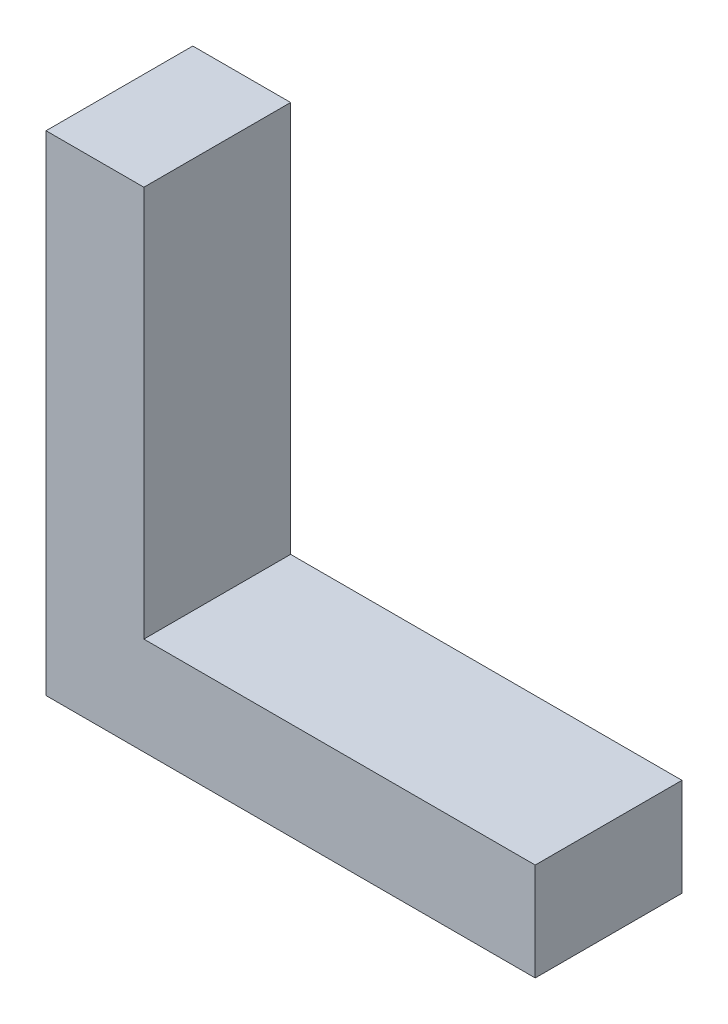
from build123d import *

# Parameters (mm, degrees)
EXTRUDE1_DEPTH = 30


with BuildPart() as part:
    # Sketch1 → Extrude1 (new body)
    with BuildSketch(Plane.XY):
        Polygon((20, 100), (20, 20), (100, 20), (100, 0), (0, 0), (0, 100), align=None)
    extrude(amount=EXTRUDE1_DEPTH)


solid = part.part
